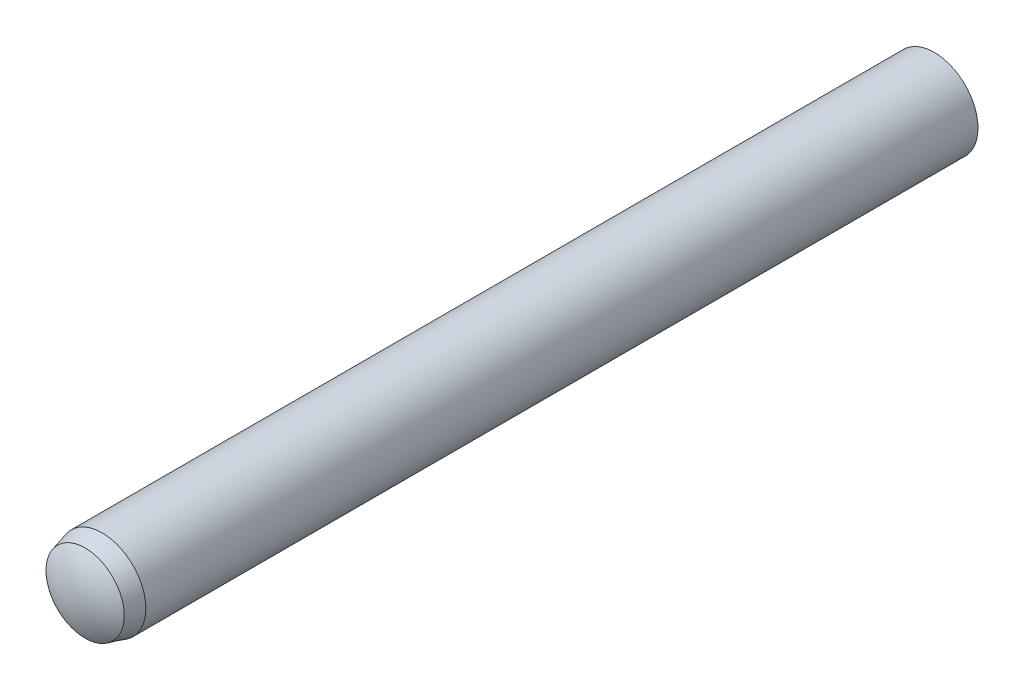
from build123d import *


with BuildPart() as part:
    # Sketch3 → Revolve1 (revolve)
    with BuildSketch(Plane(origin=(0, 0, 0), x_dir=(0, 0, -1), z_dir=(1, 0, 0))):
        with BuildLine():
            Line((-20, 0), (20, 0))
            ThreePointArc((20, 0), (19.846768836, 1.044030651), (19.4, 2))
            Line((19.4, 2), (-18.7, 2))
            Line((-18.7, 2), (-19.48, 1.79099963))
            ThreePointArc((-19.48, 1.79099963), (-19.867370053, 0.932480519), (-20, 0))
        make_face()
    revolve(axis=Axis((0, 0, 20), (0, 0, -1)))


solid = part.part
